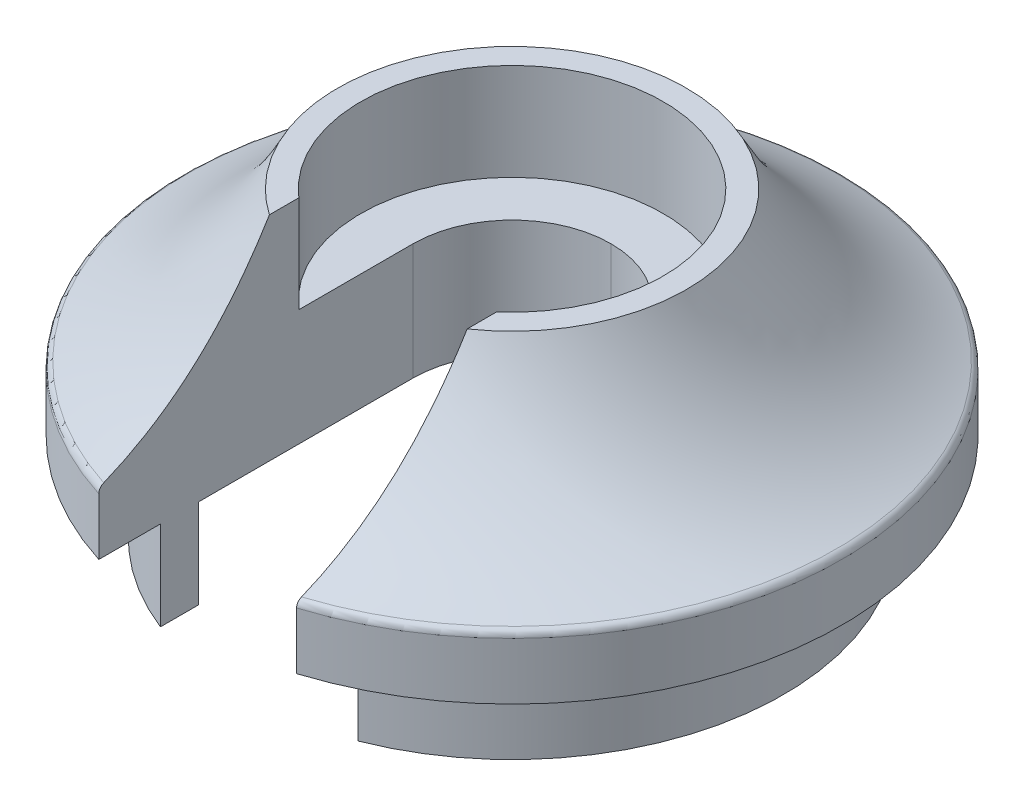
ISO-10303-21;
HEADER;
FILE_DESCRIPTION(('STEP AP214'),'2;1');
FILE_NAME('part.step','',(''),(''),'','','');
FILE_SCHEMA(('AUTOMOTIVE_DESIGN { 1 0 10303 214 1 1 1 1 }'));
ENDSEC;
DATA;
#1=APPLICATION_CONTEXT('core data for automotive mechanical design processes');
#2=APPLICATION_PROTOCOL_DEFINITION('international standard','automotive_design',2000,#1);
#3=PRODUCT_CONTEXT('',#1,'mechanical');
#4=PRODUCT('Part','Part','',(#3));
#5=PRODUCT_RELATED_PRODUCT_CATEGORY('part','',(#4));
#6=PRODUCT_DEFINITION_FORMATION('','',#4);
#7=PRODUCT_DEFINITION_CONTEXT('part definition',#1,'design');
#8=PRODUCT_DEFINITION('design','',#6,#7);
#9=PRODUCT_DEFINITION_SHAPE('','',#8);
#10=(LENGTH_UNIT() NAMED_UNIT(*) SI_UNIT(.MILLI.,.METRE.));
#11=(NAMED_UNIT(*) PLANE_ANGLE_UNIT() SI_UNIT($,.RADIAN.));
#12=(NAMED_UNIT(*) SI_UNIT($,.STERADIAN.) SOLID_ANGLE_UNIT());
#13=UNCERTAINTY_MEASURE_WITH_UNIT(LENGTH_MEASURE(1.E-05),#10,'distance_accuracy_value','');
#14=(GEOMETRIC_REPRESENTATION_CONTEXT(3) GLOBAL_UNCERTAINTY_ASSIGNED_CONTEXT((#13)) GLOBAL_UNIT_ASSIGNED_CONTEXT((#10,
#11,#12)) REPRESENTATION_CONTEXT('',''));
#15=CARTESIAN_POINT('',(0.,0.,0.));
#16=DIRECTION('',(0.,0.,1.));
#17=DIRECTION('',(1.,0.,0.));
#18=AXIS2_PLACEMENT_3D('',#15,#16,#17);
#19=CARTESIAN_POINT('',(-34.347512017,27.232210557,14.670039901));
#20=DIRECTION('',(0.,-1.,0.));
#21=DIRECTION('',(0.,0.,-1.));
#22=AXIS2_PLACEMENT_3D('',#19,#20,#21);
#23=CYLINDRICAL_SURFACE('',#22,7.);
#24=DIRECTION('',(0.,1.,0.));
#25=VECTOR('',#24,1.);
#26=CARTESIAN_POINT('',(-34.347512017,24.932210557,7.670039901));
#27=LINE('',#26,#25);
#28=CARTESIAN_POINT('',(-34.347512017,24.932210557,7.670039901));
#29=VERTEX_POINT('',#28);
#30=CARTESIAN_POINT('',(-34.347512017,27.232210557,7.670039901));
#31=VERTEX_POINT('',#30);
#32=EDGE_CURVE('E186',#29,#31,#27,.T.);
#33=ORIENTED_EDGE('',*,*,#32,.F.);
#34=CARTESIAN_POINT('',(-34.347512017,24.932210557,14.670039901));
#35=DIRECTION('',(0.,1.,0.));
#36=DIRECTION('',(0.,0.,-1.));
#37=AXIS2_PLACEMENT_3D('',#34,#35,#36);
#38=CIRCLE('',#37,7.);
#39=CARTESIAN_POINT('',(-36.897512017,24.932210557,21.189050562));
#40=VERTEX_POINT('',#39);
#41=EDGE_CURVE('E207',#29,#40,#38,.T.);
#42=ORIENTED_EDGE('',*,*,#41,.T.);
#43=DIRECTION('',(0.,-1.,0.));
#44=VECTOR('',#43,1.);
#45=CARTESIAN_POINT('',(-36.897512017,27.232210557,21.189050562));
#46=LINE('',#45,#44);
#47=CARTESIAN_POINT('',(-36.897512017,27.232210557,21.189050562));
#48=VERTEX_POINT('',#47);
#49=EDGE_CURVE('E279',#48,#40,#46,.T.);
#50=ORIENTED_EDGE('',*,*,#49,.F.);
#51=CARTESIAN_POINT('',(-34.347512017,27.232210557,14.670039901));
#52=DIRECTION('',(0.,1.,0.));
#53=DIRECTION('',(0.,0.,-1.));
#54=AXIS2_PLACEMENT_3D('',#51,#52,#53);
#55=CIRCLE('',#54,7.);
#56=EDGE_CURVE('E220',#31,#48,#55,.T.);
#57=ORIENTED_EDGE('',*,*,#56,.F.);
#58=EDGE_LOOP('',(#33,#42,#50,#57));
#59=FACE_BOUND('',#58,.T.);
#60=ADVANCED_FACE('F16',(#59),#23,.T.);
#61=CARTESIAN_POINT('',(-34.347512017,27.232210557,14.670039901));
#62=DIRECTION('',(0.,-1.,0.));
#63=DIRECTION('',(0.,0.,-1.));
#64=AXIS2_PLACEMENT_3D('',#61,#62,#63);
#65=CYLINDRICAL_SURFACE('',#64,6.1);
#66=DIRECTION('',(0.,1.,0.));
#67=VECTOR('',#66,1.);
#68=CARTESIAN_POINT('',(-34.347512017,24.932210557,8.570039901));
#69=LINE('',#68,#67);
#70=CARTESIAN_POINT('',(-34.347512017,24.932210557,8.570039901));
#71=VERTEX_POINT('',#70);
#72=CARTESIAN_POINT('',(-34.347512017,27.232210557,8.570039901));
#73=VERTEX_POINT('',#72);
#74=EDGE_CURVE('E197',#71,#73,#69,.T.);
#75=ORIENTED_EDGE('',*,*,#74,.T.);
#76=CARTESIAN_POINT('',(-34.347512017,27.232210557,14.670039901));
#77=DIRECTION('',(0.,1.,0.));
#78=DIRECTION('',(0.,0.,-1.));
#79=AXIS2_PLACEMENT_3D('',#76,#77,#78);
#80=CIRCLE('',#79,6.1);
#81=CARTESIAN_POINT('',(-36.897512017,27.232210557,20.211474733));
#82=VERTEX_POINT('',#81);
#83=EDGE_CURVE('E175',#73,#82,#80,.T.);
#84=ORIENTED_EDGE('',*,*,#83,.T.);
#85=DIRECTION('',(0.,-1.,0.));
#86=VECTOR('',#85,1.);
#87=CARTESIAN_POINT('',(-36.897512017,27.232210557,20.211474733));
#88=LINE('',#87,#86);
#89=CARTESIAN_POINT('',(-36.897512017,24.932210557,20.211474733));
#90=VERTEX_POINT('',#89);
#91=EDGE_CURVE('E28',#82,#90,#88,.T.);
#92=ORIENTED_EDGE('',*,*,#91,.T.);
#93=CARTESIAN_POINT('',(-34.347512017,24.932210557,14.670039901));
#94=DIRECTION('',(0.,1.,0.));
#95=DIRECTION('',(0.,0.,-1.));
#96=AXIS2_PLACEMENT_3D('',#93,#94,#95);
#97=CIRCLE('',#96,6.1);
#98=EDGE_CURVE('E206',#71,#90,#97,.T.);
#99=ORIENTED_EDGE('',*,*,#98,.F.);
#100=EDGE_LOOP('',(#75,#84,#92,#99));
#101=FACE_BOUND('',#100,.T.);
#102=ADVANCED_FACE('F761',(#101),#65,.F.);
#103=CARTESIAN_POINT('',(-34.347512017,28.832210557,14.670039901));
#104=DIRECTION('',(0.,-1.,0.));
#105=DIRECTION('',(0.,0.,-1.));
#106=AXIS2_PLACEMENT_3D('',#103,#104,#105);
#107=CYLINDRICAL_SURFACE('',#106,8.5);
#108=DIRECTION('',(0.,1.,0.));
#109=VECTOR('',#108,1.);
#110=CARTESIAN_POINT('',(-34.347512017,27.232210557,6.170039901));
#111=LINE('',#110,#109);
#112=CARTESIAN_POINT('',(-34.347512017,27.232210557,6.170039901));
#113=VERTEX_POINT('',#112);
#114=CARTESIAN_POINT('',(-34.347512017,28.698691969,6.170039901));
#115=VERTEX_POINT('',#114);
#116=EDGE_CURVE('E273',#113,#115,#111,.T.);
#117=ORIENTED_EDGE('',*,*,#116,.F.);
#118=CARTESIAN_POINT('',(-34.347512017,27.232210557,14.670039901));
#119=DIRECTION('',(0.,1.,0.));
#120=DIRECTION('',(0.,0.,-1.));
#121=AXIS2_PLACEMENT_3D('',#118,#119,#120);
#122=CIRCLE('',#121,8.5);
#123=CARTESIAN_POINT('',(-36.897512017,27.232210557,22.778523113));
#124=VERTEX_POINT('',#123);
#125=EDGE_CURVE('E247',#113,#124,#122,.T.);
#126=ORIENTED_EDGE('',*,*,#125,.T.);
#127=DIRECTION('',(0.,-1.,0.));
#128=VECTOR('',#127,1.);
#129=CARTESIAN_POINT('',(-36.897512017,28.698691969,22.778523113));
#130=LINE('',#129,#128);
#131=CARTESIAN_POINT('',(-36.897512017,28.698691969,22.778523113));
#132=VERTEX_POINT('',#131);
#133=EDGE_CURVE('E282',#132,#124,#130,.T.);
#134=ORIENTED_EDGE('',*,*,#133,.F.);
#135=CARTESIAN_POINT('',(-34.347512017,28.698691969,14.670039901));
#136=DIRECTION('',(0.,-1.,0.));
#137=DIRECTION('',(0.,0.,-1.));
#138=AXIS2_PLACEMENT_3D('',#135,#136,#137);
#139=CIRCLE('',#138,8.5);
#140=EDGE_CURVE('E11',#132,#115,#139,.T.);
#141=ORIENTED_EDGE('',*,*,#140,.T.);
#142=EDGE_LOOP('',(#117,#126,#134,#141));
#143=FACE_BOUND('',#142,.T.);
#144=ADVANCED_FACE('F319',(#143),#107,.T.);
#145=CARTESIAN_POINT('',(-34.347512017,28.698691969,14.670039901));
#146=DIRECTION('',(0.,-1.,0.));
#147=DIRECTION('',(0.,0.,-1.));
#148=AXIS2_PLACEMENT_3D('',#145,#146,#147);
#149=TOROIDAL_SURFACE('',#148,8.3,0.2);
#150=CARTESIAN_POINT('',(-34.347512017,28.698691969,6.370039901));
#151=DIRECTION('',(1.,0.,0.));
#152=DIRECTION('',(0.,0.,-1.));
#153=AXIS2_PLACEMENT_3D('',#150,#151,#152);
#154=CIRCLE('',#153,0.2);
#155=CARTESIAN_POINT('',(-34.347512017,28.882699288,6.291673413));
#156=VERTEX_POINT('',#155);
#157=EDGE_CURVE('E287',#115,#156,#154,.T.);
#158=ORIENTED_EDGE('',*,*,#157,.F.);
#159=ORIENTED_EDGE('',*,*,#140,.F.);
#160=CARTESIAN_POINT('',(-36.8975120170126,28.698691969,22.7785231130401));
#161=CARTESIAN_POINT('',(-36.8975120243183,28.7008552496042,22.7785231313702));
#162=CARTESIAN_POINT('',(-36.8975136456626,28.703018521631,22.7784858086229));
#163=CARTESIAN_POINT('',(-36.8975195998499,28.7073602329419,22.7783361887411));
#164=CARTESIAN_POINT('',(-36.8975239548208,28.7095386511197,22.7782232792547));
#165=CARTESIAN_POINT('',(-36.8975348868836,28.7139082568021,22.7779209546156));
#166=CARTESIAN_POINT('',(-36.8975414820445,28.716099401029,22.7777309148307));
#167=CARTESIAN_POINT('',(-36.8975564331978,28.7204919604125,22.7772728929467));
#168=CARTESIAN_POINT('',(-36.897564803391,28.7226933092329,22.7770042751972));
#169=CARTESIAN_POINT('',(-36.8975828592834,28.7271036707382,22.7763877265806));
#170=CARTESIAN_POINT('',(-36.8975925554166,28.7293125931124,22.7760391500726));
#171=CARTESIAN_POINT('',(-36.897612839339,28.7337353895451,22.7752613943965));
#172=CARTESIAN_POINT('',(-36.8976234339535,28.7359491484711,22.7748315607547));
#173=CARTESIAN_POINT('',(-36.8976451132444,28.7403788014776,22.7738900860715));
#174=CARTESIAN_POINT('',(-36.8976562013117,28.7425945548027,22.7733777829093));
#175=CARTESIAN_POINT('',(-36.8976784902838,28.7470252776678,22.7722702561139));
#176=CARTESIAN_POINT('',(-36.897689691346,28.7492400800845,22.7716743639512));
#177=CARTESIAN_POINT('',(-36.8977118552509,28.7536658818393,22.7703986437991));
#178=CARTESIAN_POINT('',(-36.8977228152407,28.7558766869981,22.7697181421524));
#179=CARTESIAN_POINT('',(-36.897744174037,28.7602913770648,22.7682722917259));
#180=CARTESIAN_POINT('',(-36.8977545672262,28.7624950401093,22.7675062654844));
#181=CARTESIAN_POINT('',(-36.8977744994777,28.7668922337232,22.7658885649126));
#182=CARTESIAN_POINT('',(-36.8977840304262,28.7690855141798,22.7650362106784));
#183=CARTESIAN_POINT('',(-36.8978019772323,28.7734586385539,22.7632451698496));
#184=CARTESIAN_POINT('',(-36.897810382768,28.7756382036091,22.7623058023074));
#185=CARTESIAN_POINT('',(-36.8978258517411,28.779980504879,22.7603401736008));
#186=CARTESIAN_POINT('',(-36.8978329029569,28.782142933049,22.7593132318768));
#187=CARTESIAN_POINT('',(-36.8978454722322,28.7864474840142,22.7571720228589));
#188=CARTESIAN_POINT('',(-36.8978509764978,28.7885892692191,22.7560570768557));
#189=CARTESIAN_POINT('',(-36.8978602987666,28.7928489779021,22.7537395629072));
#190=CARTESIAN_POINT('',(-36.8978641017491,28.7949665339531,22.7525363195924));
#191=CARTESIAN_POINT('',(-36.8978699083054,28.7991741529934,22.750042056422));
#192=CARTESIAN_POINT('',(-36.897871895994,28.8012638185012,22.7487503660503));
#193=CARTESIAN_POINT('',(-36.8978740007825,28.8054119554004,22.7460792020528));
#194=CARTESIAN_POINT('',(-36.8978741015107,28.8074699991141,22.7446990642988));
#195=CARTESIAN_POINT('',(-36.8978724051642,28.8115511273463,22.7418511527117));
#196=CARTESIAN_POINT('',(-36.8978705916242,28.8135737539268,22.7403827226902));
#197=CARTESIAN_POINT('',(-36.8978650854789,28.8175802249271,22.7373585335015));
#198=CARTESIAN_POINT('',(-36.8978613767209,28.8195635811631,22.7358021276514));
#199=CARTESIAN_POINT('',(-36.8978521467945,28.8234876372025,22.7326024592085));
#200=CARTESIAN_POINT('',(-36.8978466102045,28.8254278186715,22.7309585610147));
#201=CARTESIAN_POINT('',(-36.897833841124,28.8292616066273,22.7275845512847));
#202=CARTESIAN_POINT('',(-36.8978265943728,28.8311546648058,22.7258538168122));
#203=CARTESIAN_POINT('',(-36.8978105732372,28.8348902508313,22.722306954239));
#204=CARTESIAN_POINT('',(-36.8978017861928,28.8367322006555,22.7204902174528));
#205=CARTESIAN_POINT('',(-36.8977829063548,28.8403615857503,22.7167723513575));
#206=CARTESIAN_POINT('',(-36.8977728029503,28.8421484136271,22.7148706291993));
#207=CARTESIAN_POINT('',(-36.8977515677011,28.8456635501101,22.7109839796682));
#208=CARTESIAN_POINT('',(-36.8977404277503,28.8473912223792,22.7089984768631));
#209=CARTESIAN_POINT('',(-36.8977174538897,28.8507840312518,22.7049456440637));
#210=CARTESIAN_POINT('',(-36.8977056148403,28.8524485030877,22.7028777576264));
#211=CARTESIAN_POINT('',(-36.8976816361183,28.8557108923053,22.6986617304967));
#212=CARTESIAN_POINT('',(-36.897669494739,28.8573081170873,22.6965130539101));
#213=CARTESIAN_POINT('',(-36.8976453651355,28.8604320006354,22.6921372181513));
#214=CARTESIAN_POINT('',(-36.8976333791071,28.8619579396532,22.6899095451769));
#215=CARTESIAN_POINT('',(-36.8976100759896,28.8649352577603,22.6853776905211));
#216=CARTESIAN_POINT('',(-36.8975987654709,28.8663858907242,22.6830730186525));
#217=CARTESIAN_POINT('',(-36.8975773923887,28.8692086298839,22.6783893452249));
#218=CARTESIAN_POINT('',(-36.8975673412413,28.8705799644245,22.676009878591));
#219=CARTESIAN_POINT('',(-36.8975491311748,28.8732401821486,22.6711790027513));
#220=CARTESIAN_POINT('',(-36.8975409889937,28.8745282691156,22.6687271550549));
#221=CARTESIAN_POINT('',(-36.8975273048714,28.8770181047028,22.6637541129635));
#222=CARTESIAN_POINT('',(-36.8975217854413,28.8782190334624,22.6612325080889));
#223=CARTESIAN_POINT('',(-36.8975141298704,28.8805307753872,22.6561227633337));
#224=CARTESIAN_POINT('',(-36.8975120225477,28.8816407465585,22.6535342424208));
#225=CARTESIAN_POINT('',(-36.8975120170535,28.8826992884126,22.6509248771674));
#226=B_SPLINE_CURVE_WITH_KNOTS('',3,(#160,#161,#162,#163,#164,#165,#166,#167,#168,#169,#170,
#171,#172,#173,#174,#175,#176,#177,#178,#179,#180,#181,#182,#183,#184,#185,#186,#187,#188,#189,
#190,#191,#192,#193,#194,#195,#196,#197,#198,#199,#200,#201,#202,#203,#204,#205,#206,#207,#208,
#209,#210,#211,#212,#213,#214,#215,#216,#217,#218,#219,#220,#221,#222,#223,#224,#225),
.UNSPECIFIED.,.F.,.F.,(4,2,2,2,2,2,2,2,2,2,2,2,2,2,2,2,2,2,2,2,2,2,2,2,2,2,2,2,2,2,2,2,4),(0.,
0.00648950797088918,0.0130322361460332,0.0196290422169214,0.0262807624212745,0.032988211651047,
0.0397521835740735,0.0465734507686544,0.0534527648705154,0.0603908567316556,0.0673884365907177,
0.0744461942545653,0.0815647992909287,0.0887449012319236,0.0959871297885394,0.103292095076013,
0.110660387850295,0.118092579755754,0.125589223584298,0.133150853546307,0.140777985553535,
0.14847111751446,0.15623072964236,0.164057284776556,0.171951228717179,0.179912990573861,
0.18794298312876,0.196041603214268,0.204209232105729,0.21244623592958,0.22075296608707,
0.229129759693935,0.237576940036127),.UNSPECIFIED.);
#227=CARTESIAN_POINT('',(-36.897512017,28.882699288,22.650924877));
#228=VERTEX_POINT('',#227);
#229=EDGE_CURVE('E264',#132,#228,#226,.T.);
#230=ORIENTED_EDGE('',*,*,#229,.T.);
#231=CARTESIAN_POINT('',(-34.347512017,28.882699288,14.670039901));
#232=DIRECTION('',(0.,1.,0.));
#233=DIRECTION('',(0.,0.,-1.));
#234=AXIS2_PLACEMENT_3D('',#231,#232,#233);
#235=CIRCLE('',#234,8.378366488);
#236=EDGE_CURVE('E458',#156,#228,#235,.T.);
#237=ORIENTED_EDGE('',*,*,#236,.F.);
#238=EDGE_LOOP('',(#158,#159,#230,#237));
#239=FACE_BOUND('',#238,.T.);
#240=ADVANCED_FACE('F308',(#239),#149,.T.);
#241=CARTESIAN_POINT('',(-34.347512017,34.932210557,14.670039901));
#242=DIRECTION('',(0.,-1.,0.));
#243=DIRECTION('',(0.,0.,-1.));
#244=AXIS2_PLACEMENT_3D('',#241,#242,#243);
#245=CYLINDRICAL_SURFACE('',#244,2.55);
#246=DIRECTION('',(0.,1.,0.));
#247=VECTOR('',#246,1.);
#248=CARTESIAN_POINT('',(-34.347512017,27.232210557,12.120039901));
#249=LINE('',#248,#247);
#250=CARTESIAN_POINT('',(-34.347512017,27.232210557,12.120039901));
#251=VERTEX_POINT('',#250);
#252=CARTESIAN_POINT('',(-34.347512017,30.232210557,12.120039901));
#253=VERTEX_POINT('',#252);
#254=EDGE_CURVE('E229',#251,#253,#249,.T.);
#255=ORIENTED_EDGE('',*,*,#254,.T.);
#256=CARTESIAN_POINT('',(-34.347512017,30.232210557,14.670039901));
#257=DIRECTION('',(0.,-1.,0.));
#258=DIRECTION('',(0.,0.,-1.));
#259=AXIS2_PLACEMENT_3D('',#256,#257,#258);
#260=CIRCLE('',#259,2.55);
#261=CARTESIAN_POINT('',(-36.897512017,30.232210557,14.670039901));
#262=VERTEX_POINT('',#261);
#263=EDGE_CURVE('E525',#262,#253,#260,.T.);
#264=ORIENTED_EDGE('',*,*,#263,.F.);
#265=DIRECTION('',(0.,-1.,0.));
#266=VECTOR('',#265,1.);
#267=CARTESIAN_POINT('',(-36.897512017,30.232210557,14.670039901));
#268=LINE('',#267,#266);
#269=CARTESIAN_POINT('',(-36.897512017,27.232210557,14.670039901));
#270=VERTEX_POINT('',#269);
#271=EDGE_CURVE('E262',#262,#270,#268,.T.);
#272=ORIENTED_EDGE('',*,*,#271,.T.);
#273=CARTESIAN_POINT('',(-34.347512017,27.232210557,14.670039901));
#274=DIRECTION('',(0.,-1.,0.));
#275=DIRECTION('',(0.,0.,-1.));
#276=AXIS2_PLACEMENT_3D('',#273,#274,#275);
#277=CIRCLE('',#276,2.55);
#278=EDGE_CURVE('E174',#270,#251,#277,.T.);
#279=ORIENTED_EDGE('',*,*,#278,.T.);
#280=EDGE_LOOP('',(#255,#264,#272,#279));
#281=FACE_BOUND('',#280,.T.);
#282=ADVANCED_FACE('F318',(#281),#245,.F.);
#283=CARTESIAN_POINT('',(-31.797512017,34.932210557,26.007758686));
#284=DIRECTION('',(-1.,0.,0.));
#285=DIRECTION('',(0.,0.,1.));
#286=AXIS2_PLACEMENT_3D('',#283,#284,#285);
#287=PLANE('',#286);
#288=DIRECTION('',(0.,0.,-1.));
#289=VECTOR('',#288,1.);
#290=CARTESIAN_POINT('',(-31.797512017,24.932210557,21.189050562));
#291=LINE('',#290,#289);
#292=CARTESIAN_POINT('',(-31.797512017,24.932210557,21.189050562));
#293=VERTEX_POINT('',#292);
#294=CARTESIAN_POINT('',(-31.797512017,24.932210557,20.211474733));
#295=VERTEX_POINT('',#294);
#296=EDGE_CURVE('E203',#293,#295,#291,.T.);
#297=ORIENTED_EDGE('',*,*,#296,.F.);
#298=DIRECTION('',(0.,1.,0.));
#299=VECTOR('',#298,1.);
#300=CARTESIAN_POINT('',(-31.797512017,24.932210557,21.189050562));
#301=LINE('',#300,#299);
#302=CARTESIAN_POINT('',(-31.797512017,27.232210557,21.189050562));
#303=VERTEX_POINT('',#302);
#304=EDGE_CURVE('E214',#293,#303,#301,.T.);
#305=ORIENTED_EDGE('',*,*,#304,.T.);
#306=DIRECTION('',(0.,0.,1.));
#307=VECTOR('',#306,1.);
#308=CARTESIAN_POINT('',(-31.797512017,27.232210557,21.189050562));
#309=LINE('',#308,#307);
#310=CARTESIAN_POINT('',(-31.797512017,27.232210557,22.778523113));
#311=VERTEX_POINT('',#310);
#312=EDGE_CURVE('E225',#303,#311,#309,.T.);
#313=ORIENTED_EDGE('',*,*,#312,.T.);
#314=DIRECTION('',(0.,1.,0.));
#315=VECTOR('',#314,1.);
#316=CARTESIAN_POINT('',(-31.797512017,27.232210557,22.778523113));
#317=LINE('',#316,#315);
#318=CARTESIAN_POINT('',(-31.797512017,28.698691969,22.778523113));
#319=VERTEX_POINT('',#318);
#320=EDGE_CURVE('E277',#311,#319,#317,.T.);
#321=ORIENTED_EDGE('',*,*,#320,.T.);
#322=CARTESIAN_POINT('',(-31.7975120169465,28.8826992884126,22.6509248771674));
#323=CARTESIAN_POINT('',(-31.7975120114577,28.881640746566,22.653534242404));
#324=CARTESIAN_POINT('',(-31.7975099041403,28.8805307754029,22.6561227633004));
#325=CARTESIAN_POINT('',(-31.7975022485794,28.8782190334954,22.6612325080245));
#326=CARTESIAN_POINT('',(-31.797496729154,28.8770181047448,22.6637541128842));
#327=CARTESIAN_POINT('',(-31.7974830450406,28.8745282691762,22.6687271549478));
#328=CARTESIAN_POINT('',(-31.7974749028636,28.873240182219,22.6711790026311));
#329=CARTESIAN_POINT('',(-31.7974566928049,28.8705799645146,22.6760098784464));
#330=CARTESIAN_POINT('',(-31.7974466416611,28.869208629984,22.678389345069));
#331=CARTESIAN_POINT('',(-31.7974252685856,28.8663858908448,22.6830730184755));
#332=CARTESIAN_POINT('',(-31.7974139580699,28.8649352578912,22.6853776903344));
#333=CARTESIAN_POINT('',(-31.797390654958,28.8619579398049,22.6899095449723));
#334=CARTESIAN_POINT('',(-31.7973786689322,28.8604320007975,22.6921372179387));
#335=CARTESIAN_POINT('',(-31.7973545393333,28.8573081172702,22.6965130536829));
#336=CARTESIAN_POINT('',(-31.797342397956,28.8557108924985,22.698661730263));
#337=CARTESIAN_POINT('',(-31.7973184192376,28.8524485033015,22.7028777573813));
#338=CARTESIAN_POINT('',(-31.7973065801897,28.8507840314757,22.7049456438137));
#339=CARTESIAN_POINT('',(-31.7972836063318,28.847391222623,22.7089984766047));
#340=CARTESIAN_POINT('',(-31.7972724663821,28.8456635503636,22.7109839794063));
#341=CARTESIAN_POINT('',(-31.7972512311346,28.8421484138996,22.7148706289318));
#342=CARTESIAN_POINT('',(-31.7972411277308,28.840361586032,22.716772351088));
#343=CARTESIAN_POINT('',(-31.7972222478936,28.836732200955,22.7204902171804));
#344=CARTESIAN_POINT('',(-31.7972134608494,28.8348902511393,22.7223069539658));
#345=CARTESIAN_POINT('',(-31.7971974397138,28.8311546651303,22.7258538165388));
#346=CARTESIAN_POINT('',(-31.7971901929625,28.8292616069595,22.7275845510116));
#347=CARTESIAN_POINT('',(-31.7971774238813,28.8254278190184,22.7309585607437));
#348=CARTESIAN_POINT('',(-31.7971718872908,28.8234876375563,22.7326024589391));
#349=CARTESIAN_POINT('',(-31.797162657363,28.8195635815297,22.7358021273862));
#350=CARTESIAN_POINT('',(-31.7971589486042,28.8175802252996,22.7373585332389));
#351=CARTESIAN_POINT('',(-31.7971534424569,28.8135737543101,22.7403827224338));
#352=CARTESIAN_POINT('',(-31.7971516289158,28.8115511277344,22.7418511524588));
#353=CARTESIAN_POINT('',(-31.7971499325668,28.8074699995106,22.7446990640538));
#354=CARTESIAN_POINT('',(-31.7971500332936,28.8054119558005,22.7460792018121));
#355=CARTESIAN_POINT('',(-31.7971521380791,28.8012638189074,22.748750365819));
#356=CARTESIAN_POINT('',(-31.7971541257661,28.799174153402,22.7500420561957));
#357=CARTESIAN_POINT('',(-31.797159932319,28.7949665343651,22.7525363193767));
#358=CARTESIAN_POINT('',(-31.7971637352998,28.7928489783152,22.7537395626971));
#359=CARTESIAN_POINT('',(-31.7971730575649,28.788589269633,22.7560570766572));
#360=CARTESIAN_POINT('',(-31.7971785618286,28.7864474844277,22.7571720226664));
#361=CARTESIAN_POINT('',(-31.7971911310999,28.7821429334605,22.7593132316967));
#362=CARTESIAN_POINT('',(-31.7971981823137,28.7799805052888,22.760340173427));
#363=CARTESIAN_POINT('',(-31.7972136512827,28.775638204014,22.7623058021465));
#364=CARTESIAN_POINT('',(-31.7972220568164,28.7734586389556,22.7632451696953));
#365=CARTESIAN_POINT('',(-31.7972400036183,28.7690855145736,22.7650362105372));
#366=CARTESIAN_POINT('',(-31.7972495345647,28.7668922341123,22.7658885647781));
#367=CARTESIAN_POINT('',(-31.7972694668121,28.7624950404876,22.7675062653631));
#368=CARTESIAN_POINT('',(-31.7972798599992,28.7602913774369,22.7682722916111));
#369=CARTESIAN_POINT('',(-31.7973012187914,28.7558766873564,22.7697181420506));
#370=CARTESIAN_POINT('',(-31.7973121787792,28.7536658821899,22.7703986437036));
#371=CARTESIAN_POINT('',(-31.7973343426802,28.7492400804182,22.7716743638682));
#372=CARTESIAN_POINT('',(-31.7973455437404,28.7470252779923,22.772270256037));
#373=CARTESIAN_POINT('',(-31.7973678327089,28.7425945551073,22.773377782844));
#374=CARTESIAN_POINT('',(-31.7973789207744,28.7403788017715,22.7738900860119));
#375=CARTESIAN_POINT('',(-31.7974006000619,28.7359491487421,22.7748315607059));
#376=CARTESIAN_POINT('',(-31.7974111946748,28.7337353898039,22.7752613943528));
#377=CARTESIAN_POINT('',(-31.7974314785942,28.7293125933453,22.7760391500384));
#378=CARTESIAN_POINT('',(-31.797441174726,28.7271036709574,22.7763877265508));
#379=CARTESIAN_POINT('',(-31.7974592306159,28.7226933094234,22.7770042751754));
#380=CARTESIAN_POINT('',(-31.7974676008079,28.7204919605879,22.7772728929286));
#381=CARTESIAN_POINT('',(-31.7974825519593,28.7160994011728,22.7777309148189));
#382=CARTESIAN_POINT('',(-31.7974891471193,28.7139082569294,22.7779209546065));
#383=CARTESIAN_POINT('',(-31.7975000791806,28.7095386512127,22.7782232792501));
#384=CARTESIAN_POINT('',(-31.797504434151,28.7073602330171,22.7783361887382));
#385=CARTESIAN_POINT('',(-31.7975103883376,28.7030185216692,22.7784858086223));
#386=CARTESIAN_POINT('',(-31.7975120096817,28.7008552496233,22.7785231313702));
#387=CARTESIAN_POINT('',(-31.7975120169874,28.698691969,22.7785231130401));
#388=B_SPLINE_CURVE_WITH_KNOTS('',3,(#322,#323,#324,#325,#326,#327,#328,#329,#330,#331,#332,
#333,#334,#335,#336,#337,#338,#339,#340,#341,#342,#343,#344,#345,#346,#347,#348,#349,#350,#351,
#352,#353,#354,#355,#356,#357,#358,#359,#360,#361,#362,#363,#364,#365,#366,#367,#368,#369,#370,
#371,#372,#373,#374,#375,#376,#377,#378,#379,#380,#381,#382,#383,#384,#385,#386,#387),
.UNSPECIFIED.,.F.,.F.,(4,2,2,2,2,2,2,2,2,2,2,2,2,2,2,2,2,2,2,2,2,2,2,2,2,2,2,2,2,2,2,2,4),(0.,
0.00844718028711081,0.0168239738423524,0.0251307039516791,0.0333677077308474,0.0415353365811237,
0.0496339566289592,0.0576639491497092,0.0656257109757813,0.0735196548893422,0.0813462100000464,
0.0891058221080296,0.0967989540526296,0.104426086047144,0.111987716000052,0.11948435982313,
0.126916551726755,0.134284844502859,0.141589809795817,0.148832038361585,0.156012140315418,
0.163130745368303,0.170188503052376,0.177186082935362,0.184124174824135,0.191003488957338,
0.197824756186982,0.204588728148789,0.211296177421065,0.217947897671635,0.22454470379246,
0.231087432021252,0.237576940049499),.UNSPECIFIED.);
#389=CARTESIAN_POINT('',(-31.797512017,28.882699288,22.650924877));
#390=VERTEX_POINT('',#389);
#391=EDGE_CURVE('E346',#390,#319,#388,.T.);
#392=ORIENTED_EDGE('',*,*,#391,.F.);
#393=CARTESIAN_POINT('',(-31.797512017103,32.7322105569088,18.3778020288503));
#394=CARTESIAN_POINT('',(-31.7975115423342,32.62300743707,18.4443533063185));
#395=CARTESIAN_POINT('',(-31.7975005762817,32.5147383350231,18.5124531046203));
#396=CARTESIAN_POINT('',(-31.7974698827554,32.3018780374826,18.6508785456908));
#397=CARTESIAN_POINT('',(-31.7974502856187,32.197256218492,18.721157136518));
#398=CARTESIAN_POINT('',(-31.7974140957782,31.9917374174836,18.8640037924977));
#399=CARTESIAN_POINT('',(-31.797397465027,31.8908088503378,18.9365263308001));
#400=CARTESIAN_POINT('',(-31.7973741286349,31.6927289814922,19.083917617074));
#401=CARTESIAN_POINT('',(-31.7973672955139,31.5955454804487,19.1587430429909));
#402=CARTESIAN_POINT('',(-31.7973662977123,31.4050064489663,19.310793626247));
#403=CARTESIAN_POINT('',(-31.7973719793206,31.3116186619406,19.3879783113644));
#404=CARTESIAN_POINT('',(-31.7973939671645,31.1287217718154,19.544797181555));
#405=CARTESIAN_POINT('',(-31.7974101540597,31.0391810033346,19.6243943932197));
#406=CARTESIAN_POINT('',(-31.7974467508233,30.8640283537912,19.7860851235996));
#407=CARTESIAN_POINT('',(-31.7974671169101,30.7783861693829,19.868145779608));
#408=CARTESIAN_POINT('',(-31.7974990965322,30.6110800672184,20.0348067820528));
#409=CARTESIAN_POINT('',(-31.7975107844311,30.5293880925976,20.1193789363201));
#410=CARTESIAN_POINT('',(-31.7975132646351,30.3684740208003,20.2927849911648));
#411=CARTESIAN_POINT('',(-31.7975037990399,30.2892944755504,20.3816584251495));
#412=CARTESIAN_POINT('',(-31.7974793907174,30.1345437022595,20.5628877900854));
#413=CARTESIAN_POINT('',(-31.7974644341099,30.0589821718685,20.655252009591));
#414=CARTESIAN_POINT('',(-31.797436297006,29.9116291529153,20.8435763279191));
#415=CARTESIAN_POINT('',(-31.797423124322,29.8398550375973,20.939550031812));
#416=CARTESIAN_POINT('',(-31.7974043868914,29.70023945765,21.1352062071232));
#417=CARTESIAN_POINT('',(-31.797398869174,29.6324247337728,21.2349077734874));
#418=CARTESIAN_POINT('',(-31.7973975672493,29.5008910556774,21.438132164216));
#419=CARTESIAN_POINT('',(-31.7974018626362,29.4372099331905,21.5416794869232));
#420=CARTESIAN_POINT('',(-31.7974188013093,29.3141059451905,21.7527075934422));
#421=CARTESIAN_POINT('',(-31.7974315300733,29.254733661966,21.8602178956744));
#422=CARTESIAN_POINT('',(-31.7974603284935,29.1404141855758,22.0792858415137));
#423=CARTESIAN_POINT('',(-31.7974764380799,29.0855318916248,22.190877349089));
#424=CARTESIAN_POINT('',(-31.7975020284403,28.9803449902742,22.4182178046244));
#425=CARTESIAN_POINT('',(-31.797511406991,28.9301206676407,22.5340039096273));
#426=CARTESIAN_POINT('',(-31.797512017,28.882699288,22.650924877));
#427=B_SPLINE_CURVE_WITH_KNOTS('',3,(#393,#394,#395,#396,#397,#398,#399,#400,#401,#402,#403,
#404,#405,#406,#407,#408,#409,#410,#411,#412,#413,#414,#415,#416,#417,#418,#419,#420,#421,#422,
#423,#424,#425,#426),.UNSPECIFIED.,.F.,.F.,(4,2,2,2,2,2,2,2,2,2,2,2,2,2,2,2,4),(0.,
0.383652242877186,0.761699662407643,1.13448112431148,1.5023667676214,1.86575911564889,
2.22509391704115,2.58084065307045,2.93350264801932,3.29048767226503,3.6483813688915,
4.00779495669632,4.36940701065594,4.73396250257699,5.10227071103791,5.47520200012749,
5.85368353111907),.UNSPECIFIED.);
#428=CARTESIAN_POINT('',(-31.797512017,32.732210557,18.377802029));
#429=VERTEX_POINT('',#428);
#430=EDGE_CURVE('E224',#429,#390,#427,.T.);
#431=ORIENTED_EDGE('',*,*,#430,.F.);
#432=DIRECTION('',(0.,0.,1.));
#433=VECTOR('',#432,1.);
#434=CARTESIAN_POINT('',(-31.797512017,32.732210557,17.620887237));
#435=LINE('',#434,#433);
#436=CARTESIAN_POINT('',(-31.797512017,32.732210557,17.620887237));
#437=VERTEX_POINT('',#436);
#438=EDGE_CURVE('E265',#437,#429,#435,.T.);
#439=ORIENTED_EDGE('',*,*,#438,.F.);
#440=DIRECTION('',(0.,-1.,0.));
#441=VECTOR('',#440,1.);
#442=CARTESIAN_POINT('',(-31.797512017,32.732210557,17.620887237));
#443=LINE('',#442,#441);
#444=CARTESIAN_POINT('',(-31.797512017,30.232210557,17.620887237));
#445=VERTEX_POINT('',#444);
#446=EDGE_CURVE('E260',#437,#445,#443,.T.);
#447=ORIENTED_EDGE('',*,*,#446,.T.);
#448=DIRECTION('',(0.,0.,1.));
#449=VECTOR('',#448,1.);
#450=CARTESIAN_POINT('',(-31.797512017,30.232210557,14.670039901));
#451=LINE('',#450,#449);
#452=CARTESIAN_POINT('',(-31.797512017,30.232210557,14.670039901));
#453=VERTEX_POINT('',#452);
#454=EDGE_CURVE('E201',#453,#445,#451,.T.);
#455=ORIENTED_EDGE('',*,*,#454,.F.);
#456=DIRECTION('',(0.,-1.,0.));
#457=VECTOR('',#456,1.);
#458=CARTESIAN_POINT('',(-31.797512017,30.232210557,14.670039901));
#459=LINE('',#458,#457);
#460=CARTESIAN_POINT('',(-31.797512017,27.232210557,14.670039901));
#461=VERTEX_POINT('',#460);
#462=EDGE_CURVE('E169',#453,#461,#459,.T.);
#463=ORIENTED_EDGE('',*,*,#462,.T.);
#464=DIRECTION('',(0.,0.,1.));
#465=VECTOR('',#464,1.);
#466=CARTESIAN_POINT('',(-31.797512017,27.232210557,14.670039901));
#467=LINE('',#466,#465);
#468=CARTESIAN_POINT('',(-31.797512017,27.232210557,20.211474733));
#469=VERTEX_POINT('',#468);
#470=EDGE_CURVE('E162',#461,#469,#467,.T.);
#471=ORIENTED_EDGE('',*,*,#470,.T.);
#472=DIRECTION('',(0.,1.,0.));
#473=VECTOR('',#472,1.);
#474=CARTESIAN_POINT('',(-31.797512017,24.932210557,20.211474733));
#475=LINE('',#474,#473);
#476=EDGE_CURVE('E166',#295,#469,#475,.T.);
#477=ORIENTED_EDGE('',*,*,#476,.F.);
#478=EDGE_LOOP('',(#297,#305,#313,#321,#392,#431,#439,#447,#455,#463,#471,#477));
#479=FACE_BOUND('',#478,.T.);
#480=ADVANCED_FACE('F164',(#479),#287,.T.);
#481=CARTESIAN_POINT('',(-36.897512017,34.932210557,14.670039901));
#482=DIRECTION('',(1.,0.,0.));
#483=DIRECTION('',(0.,1.,0.));
#484=AXIS2_PLACEMENT_3D('',#481,#482,#483);
#485=PLANE('',#484);
#486=DIRECTION('',(0.,0.,-1.));
#487=VECTOR('',#486,1.);
#488=CARTESIAN_POINT('',(-36.897512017,27.232210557,20.211474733));
#489=LINE('',#488,#487);
#490=EDGE_CURVE('E238',#82,#270,#489,.T.);
#491=ORIENTED_EDGE('',*,*,#490,.T.);
#492=ORIENTED_EDGE('',*,*,#271,.F.);
#493=DIRECTION('',(0.,0.,-1.));
#494=VECTOR('',#493,1.);
#495=CARTESIAN_POINT('',(-36.897512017,30.232210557,17.620887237));
#496=LINE('',#495,#494);
#497=CARTESIAN_POINT('',(-36.897512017,30.232210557,17.620887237));
#498=VERTEX_POINT('',#497);
#499=EDGE_CURVE('E255',#498,#262,#496,.T.);
#500=ORIENTED_EDGE('',*,*,#499,.F.);
#501=DIRECTION('',(0.,1.,0.));
#502=VECTOR('',#501,1.);
#503=CARTESIAN_POINT('',(-36.897512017,30.232210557,17.620887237));
#504=LINE('',#503,#502);
#505=CARTESIAN_POINT('',(-36.897512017,32.732210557,17.620887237));
#506=VERTEX_POINT('',#505);
#507=EDGE_CURVE('E257',#498,#506,#504,.T.);
#508=ORIENTED_EDGE('',*,*,#507,.T.);
#509=DIRECTION('',(0.,0.,-1.));
#510=VECTOR('',#509,1.);
#511=CARTESIAN_POINT('',(-36.897512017,32.732210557,18.377802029));
#512=LINE('',#511,#510);
#513=CARTESIAN_POINT('',(-36.897512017,32.732210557,18.377802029));
#514=VERTEX_POINT('',#513);
#515=EDGE_CURVE('E299',#514,#506,#512,.T.);
#516=ORIENTED_EDGE('',*,*,#515,.F.);
#517=CARTESIAN_POINT('',(-36.897512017,28.882699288,22.650924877));
#518=CARTESIAN_POINT('',(-36.8975126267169,28.9301133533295,22.5340219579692));
#519=CARTESIAN_POINT('',(-36.8975220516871,28.9803294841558,22.4182535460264));
#520=CARTESIAN_POINT('',(-36.8975477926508,29.0854989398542,22.1909462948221));
#521=CARTESIAN_POINT('',(-36.8975640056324,29.1403720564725,22.0793703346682));
#522=CARTESIAN_POINT('',(-36.8975930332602,29.2546723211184,21.8603314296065));
#523=CARTESIAN_POINT('',(-36.8976058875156,29.3140346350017,21.7528346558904));
#524=CARTESIAN_POINT('',(-36.8976230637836,29.4371180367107,21.5418316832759));
#525=CARTESIAN_POINT('',(-36.8976274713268,29.5007885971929,21.43829599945));
#526=CARTESIAN_POINT('',(-36.8976263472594,29.6323007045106,21.2350930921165));
#527=CARTESIAN_POINT('',(-36.8976208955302,29.7001044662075,21.1354014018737));
#528=CARTESIAN_POINT('',(-36.8976022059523,29.8396978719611,20.9397633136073));
#529=CARTESIAN_POINT('',(-36.8975890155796,29.9114608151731,20.8437978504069));
#530=CARTESIAN_POINT('',(-36.8975607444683,30.0587914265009,20.6554884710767));
#531=CARTESIAN_POINT('',(-36.897545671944,30.1343417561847,20.5631309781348));
#532=CARTESIAN_POINT('',(-36.8975208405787,30.2890702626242,20.3819136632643));
#533=CARTESIAN_POINT('',(-36.8975110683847,30.3682387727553,20.2930455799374));
#534=CARTESIAN_POINT('',(-36.8975129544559,30.529145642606,20.1196332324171));
#535=CARTESIAN_POINT('',(-36.8975243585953,30.6108421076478,20.0350500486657));
#536=CARTESIAN_POINT('',(-36.8975559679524,30.7781586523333,19.868366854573));
#537=CARTESIAN_POINT('',(-36.8975762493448,30.8638068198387,19.7862950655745));
#538=CARTESIAN_POINT('',(-36.8976127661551,31.0389729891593,19.6245819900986));
#539=CARTESIAN_POINT('',(-36.8976289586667,31.128521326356,19.5449735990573));
#540=CARTESIAN_POINT('',(-36.8976510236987,31.3114349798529,19.3881323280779));
#541=CARTESIAN_POINT('',(-36.897656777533,31.4048319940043,19.3109364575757));
#542=CARTESIAN_POINT('',(-36.897655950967,31.5953911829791,19.1588635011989));
#543=CARTESIAN_POINT('',(-36.8976492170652,31.6925856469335,19.0840269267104));
#544=CARTESIAN_POINT('',(-36.8976260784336,31.890689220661,18.9366133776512));
#545=CARTESIAN_POINT('',(-36.8976095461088,31.9916305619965,18.8640797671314));
#546=CARTESIAN_POINT('',(-36.897573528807,32.1971767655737,18.7212110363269));
#547=CARTESIAN_POINT('',(-36.8975540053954,32.3018132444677,18.6509214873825));
#548=CARTESIAN_POINT('',(-36.8975234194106,32.5147047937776,18.5124742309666));
#549=CARTESIAN_POINT('',(-36.897512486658,32.6229905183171,18.4443636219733));
#550=CARTESIAN_POINT('',(-36.8975120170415,32.732210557,18.3778020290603));
#551=B_SPLINE_CURVE_WITH_KNOTS('',3,(#517,#518,#519,#520,#521,#522,#523,#524,#525,#526,#527,
#528,#529,#530,#531,#532,#533,#534,#535,#536,#537,#538,#539,#540,#541,#542,#543,#544,#545,#546,
#547,#548,#549,#550),.UNSPECIFIED.,.F.,.F.,(4,2,2,2,2,2,2,2,2,2,2,2,2,2,2,2,4),(0.,
0.37842312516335,0.751300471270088,1.11955874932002,1.48406794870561,1.8456370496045,
2.20501080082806,2.56286762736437,2.91981866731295,3.27251378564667,3.62829655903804,
3.9876705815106,4.35110561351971,4.71903769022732,5.09186962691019,5.46997185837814,
5.85368354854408),.UNSPECIFIED.);
#552=EDGE_CURVE('E432',#228,#514,#551,.T.);
#553=ORIENTED_EDGE('',*,*,#552,.F.);
#554=ORIENTED_EDGE('',*,*,#229,.F.);
#555=ORIENTED_EDGE('',*,*,#133,.T.);
#556=DIRECTION('',(0.,0.,-1.));
#557=VECTOR('',#556,1.);
#558=CARTESIAN_POINT('',(-36.897512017,27.232210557,22.778523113));
#559=LINE('',#558,#557);
#560=EDGE_CURVE('E210',#124,#48,#559,.T.);
#561=ORIENTED_EDGE('',*,*,#560,.T.);
#562=ORIENTED_EDGE('',*,*,#49,.T.);
#563=DIRECTION('',(0.,0.,1.));
#564=VECTOR('',#563,1.);
#565=CARTESIAN_POINT('',(-36.897512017,24.932210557,20.211474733));
#566=LINE('',#565,#564);
#567=EDGE_CURVE('E237',#90,#40,#566,.T.);
#568=ORIENTED_EDGE('',*,*,#567,.F.);
#569=ORIENTED_EDGE('',*,*,#91,.F.);
#570=EDGE_LOOP('',(#491,#492,#500,#508,#516,#553,#554,#555,#561,#562,#568,#569));
#571=FACE_BOUND('',#570,.T.);
#572=ADVANCED_FACE('F18',(#571),#485,.T.);
#573=CARTESIAN_POINT('',(-34.347512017,32.732210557,14.670039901));
#574=DIRECTION('',(0.,1.,0.));
#575=DIRECTION('',(1.,0.,0.));
#576=AXIS2_PLACEMENT_3D('',#573,#574,#575);
#577=PLANE('',#576);
#578=CARTESIAN_POINT('',(-31.797512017,32.732210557,18.377802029));
#579=CARTESIAN_POINT('',(-29.066862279,32.732210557,16.499807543));
#580=CARTESIAN_POINT('',(-30.05013319,32.732210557,13.334923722));
#581=CARTESIAN_POINT('',(-31.033404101,32.732210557,10.170039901));
#582=CARTESIAN_POINT('',(-34.347512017,32.732210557,10.170039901));
#583=CARTESIAN_POINT('',(-37.661619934,32.732210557,10.170039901));
#584=CARTESIAN_POINT('',(-38.644890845,32.732210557,13.334923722));
#585=CARTESIAN_POINT('',(-39.628161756,32.732210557,16.499807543));
#586=CARTESIAN_POINT('',(-36.897512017,32.732210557,18.377802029));
#587=(BOUNDED_CURVE() B_SPLINE_CURVE(2,(#578,#579,#580,#581,#582,#583,#584,#585,#586),
.UNSPECIFIED.,.F.,.F.) B_SPLINE_CURVE_WITH_KNOTS((3,2,2,2,3),(34.518107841,107.259053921,180.,
252.740946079,325.481892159),
.UNSPECIFIED.) CURVE() GEOMETRIC_REPRESENTATION_ITEM() RATIONAL_B_SPLINE_CURVE((1.,0.805199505,
1.,0.805199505,1.,0.805199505,1.,0.805199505,1.)) REPRESENTATION_ITEM(''));
#588=EDGE_CURVE('E256',#429,#514,#587,.T.);
#589=ORIENTED_EDGE('',*,*,#588,.T.);
#590=ORIENTED_EDGE('',*,*,#515,.T.);
#591=CARTESIAN_POINT('',(-34.347512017,32.732210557,14.670039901));
#592=DIRECTION('',(0.,1.,0.));
#593=DIRECTION('',(0.,0.,1.));
#594=AXIS2_PLACEMENT_3D('',#591,#592,#593);
#595=CIRCLE('',#594,3.9);
#596=EDGE_CURVE('E295',#437,#506,#595,.T.);
#597=ORIENTED_EDGE('',*,*,#596,.F.);
#598=ORIENTED_EDGE('',*,*,#438,.T.);
#599=EDGE_LOOP('',(#589,#590,#597,#598));
#600=FACE_BOUND('',#599,.T.);
#601=ADVANCED_FACE('F777',(#600),#577,.T.);
#602=CARTESIAN_POINT('',(-34.347512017,30.232210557,14.670039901));
#603=DIRECTION('',(0.,1.,0.));
#604=DIRECTION('',(0.,0.,1.));
#605=AXIS2_PLACEMENT_3D('',#602,#603,#604);
#606=CYLINDRICAL_SURFACE('',#605,3.9);
#607=ORIENTED_EDGE('',*,*,#507,.F.);
#608=CARTESIAN_POINT('',(-34.347512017,30.232210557,14.670039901));
#609=DIRECTION('',(0.,1.,0.));
#610=DIRECTION('',(0.,0.,1.));
#611=AXIS2_PLACEMENT_3D('',#608,#609,#610);
#612=CIRCLE('',#611,3.9);
#613=EDGE_CURVE('E251',#445,#498,#612,.T.);
#614=ORIENTED_EDGE('',*,*,#613,.F.);
#615=ORIENTED_EDGE('',*,*,#446,.F.);
#616=ORIENTED_EDGE('',*,*,#596,.T.);
#617=EDGE_LOOP('',(#607,#614,#615,#616));
#618=FACE_BOUND('',#617,.T.);
#619=ADVANCED_FACE('F781',(#618),#606,.F.);
#620=CARTESIAN_POINT('',(-34.347512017,30.232210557,14.670039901));
#621=DIRECTION('',(0.,1.,0.));
#622=DIRECTION('',(1.,0.,0.));
#623=AXIS2_PLACEMENT_3D('',#620,#621,#622);
#624=PLANE('',#623);
#625=ORIENTED_EDGE('',*,*,#613,.T.);
#626=ORIENTED_EDGE('',*,*,#499,.T.);
#627=ORIENTED_EDGE('',*,*,#263,.T.);
#628=CARTESIAN_POINT('',(-34.347512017,30.232210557,14.670039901));
#629=DIRECTION('',(0.,-1.,0.));
#630=DIRECTION('',(0.,0.,-1.));
#631=AXIS2_PLACEMENT_3D('',#628,#629,#630);
#632=CIRCLE('',#631,2.55);
#633=EDGE_CURVE('E283',#253,#453,#632,.T.);
#634=ORIENTED_EDGE('',*,*,#633,.T.);
#635=ORIENTED_EDGE('',*,*,#454,.T.);
#636=EDGE_LOOP('',(#625,#626,#627,#634,#635));
#637=FACE_BOUND('',#636,.T.);
#638=ADVANCED_FACE('F411',(#637),#624,.T.);
#639=CARTESIAN_POINT('',(-32.9779133,32.732210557,18.95655356));
#640=CARTESIAN_POINT('',(-26.429648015,32.732210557,16.864294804));
#641=CARTESIAN_POINT('',(-27.624371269,32.732210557,10.170039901));
#642=CARTESIAN_POINT('',(-34.347512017,32.732210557,10.170039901));
#643=CARTESIAN_POINT('',(-34.347529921,32.732210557,10.170039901));
#644=CARTESIAN_POINT('',(-34.347547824,32.732210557,10.170039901));
#645=CARTESIAN_POINT('',(-34.347565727,32.732210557,10.170039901));
#646=CARTESIAN_POINT('',(-41.070667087,32.732210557,10.170120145));
#647=CARTESIAN_POINT('',(-42.265284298,32.732210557,16.86432411));
#648=CARTESIAN_POINT('',(-35.717110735,32.732210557,18.95655356));
#649=CARTESIAN_POINT('',(-32.550671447,29.936604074,20.293717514));
#650=CARTESIAN_POINT('',(-23.959696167,29.936604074,17.548785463));
#651=CARTESIAN_POINT('',(-25.527109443,29.936604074,8.76627958));
#652=CARTESIAN_POINT('',(-34.347512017,29.936604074,8.76627958));
#653=CARTESIAN_POINT('',(-34.347535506,29.936604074,8.76627958));
#654=CARTESIAN_POINT('',(-34.347558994,29.936604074,8.76627958));
#655=CARTESIAN_POINT('',(-34.347582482,29.936604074,8.76627958));
#656=CARTESIAN_POINT('',(-43.16793338,29.936604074,8.766384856));
#657=CARTESIAN_POINT('',(-44.735207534,29.936604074,17.548823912));
#658=CARTESIAN_POINT('',(-36.144352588,29.936604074,20.293717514));
#659=CARTESIAN_POINT('',(-31.797512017,28.882699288,22.650924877));
#660=CARTESIAN_POINT('',(-19.605563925,28.882699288,18.755433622));
#661=CARTESIAN_POINT('',(-21.82997043,28.882699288,6.291673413));
#662=CARTESIAN_POINT('',(-34.347512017,28.882699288,6.291673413));
#663=CARTESIAN_POINT('',(-34.347545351,28.882699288,6.291673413));
#664=CARTESIAN_POINT('',(-34.347578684,28.882699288,6.291673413));
#665=CARTESIAN_POINT('',(-34.347612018,28.882699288,6.291673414));
#666=CARTESIAN_POINT('',(-46.865080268,28.882699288,6.29182281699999));
#667=CARTESIAN_POINT('',(-49.089289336,28.882699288,18.755488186));
#668=CARTESIAN_POINT('',(-36.897512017,28.882699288,22.650924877));
#669=(BOUNDED_SURFACE() B_SPLINE_SURFACE(2,3,((#639,#640,#641,#642,#643,#644,#645,#646,#647,
#648),(#649,#650,#651,#652,#653,#654,#655,#656,#657,#658),(#659,#660,#661,#662,#663,#664,#665,
#666,#667,#668)),.UNSPECIFIED.,.F.,.F.,.F.) B_SPLINE_SURFACE_WITH_KNOTS((3,3),(4,3,3,4),(0.,
0.853327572),(0.008453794,0.5,0.500003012,0.991546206),
.UNSPECIFIED.) GEOMETRIC_REPRESENTATION_ITEM() RATIONAL_B_SPLINE_SURFACE(((0.971317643,
0.424966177,0.434526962,1.,0.999996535,0.999993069,0.999989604,0.434526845,0.424969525,
0.971317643),(0.971317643,0.424966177,0.434526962,1.,0.999996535,0.999993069,0.999989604,
0.434526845,0.424969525,0.971317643),(0.971317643,0.424966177,0.434526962,1.,0.999996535,
0.999993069,0.999989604,0.434526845,0.424969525,0.971317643))) REPRESENTATION_ITEM('') SURFACE());
#670=CARTESIAN_POINT('',(-34.347512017,28.882699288,14.670039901));
#671=DIRECTION('',(0.,1.,0.));
#672=DIRECTION('',(0.,0.,-1.));
#673=AXIS2_PLACEMENT_3D('',#670,#671,#672);
#674=CIRCLE('',#673,8.378366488);
#675=EDGE_CURVE('E367',#390,#156,#674,.T.);
#676=ORIENTED_EDGE('',*,*,#430,.T.);
#677=ORIENTED_EDGE('',*,*,#675,.T.);
#678=ORIENTED_EDGE('',*,*,#236,.T.);
#679=ORIENTED_EDGE('',*,*,#552,.T.);
#680=ORIENTED_EDGE('',*,*,#588,.F.);
#681=EDGE_LOOP('',(#676,#677,#678,#679,#680));
#682=FACE_BOUND('',#681,.T.);
#683=ADVANCED_FACE('F400',(#682),#669,.T.);
#684=CARTESIAN_POINT('',(-34.347512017,27.232210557,14.670039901));
#685=DIRECTION('',(0.,1.,0.));
#686=DIRECTION('',(1.,0.,0.));
#687=AXIS2_PLACEMENT_3D('',#684,#685,#686);
#688=PLANE('',#687);
#689=ORIENTED_EDGE('',*,*,#560,.F.);
#690=ORIENTED_EDGE('',*,*,#125,.F.);
#691=CARTESIAN_POINT('',(-34.347512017,27.232210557,14.670039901));
#692=DIRECTION('',(0.,1.,0.));
#693=DIRECTION('',(0.,0.,-1.));
#694=AXIS2_PLACEMENT_3D('',#691,#692,#693);
#695=CIRCLE('',#694,8.5);
#696=EDGE_CURVE('E213',#311,#113,#695,.T.);
#697=ORIENTED_EDGE('',*,*,#696,.F.);
#698=ORIENTED_EDGE('',*,*,#312,.F.);
#699=CARTESIAN_POINT('',(-34.347512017,27.232210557,14.670039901));
#700=DIRECTION('',(0.,1.,0.));
#701=DIRECTION('',(0.,0.,-1.));
#702=AXIS2_PLACEMENT_3D('',#699,#700,#701);
#703=CIRCLE('',#702,7.);
#704=EDGE_CURVE('E219',#303,#31,#703,.T.);
#705=ORIENTED_EDGE('',*,*,#704,.T.);
#706=ORIENTED_EDGE('',*,*,#56,.T.);
#707=EDGE_LOOP('',(#689,#690,#697,#698,#705,#706));
#708=FACE_BOUND('',#707,.T.);
#709=ADVANCED_FACE('F329',(#708),#688,.F.);
#710=CARTESIAN_POINT('',(-34.347512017,27.232210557,14.670039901));
#711=DIRECTION('',(0.,1.,0.));
#712=DIRECTION('',(1.,0.,0.));
#713=AXIS2_PLACEMENT_3D('',#710,#711,#712);
#714=PLANE('',#713);
#715=ORIENTED_EDGE('',*,*,#490,.F.);
#716=ORIENTED_EDGE('',*,*,#83,.F.);
#717=CARTESIAN_POINT('',(-34.347512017,27.232210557,14.670039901));
#718=DIRECTION('',(0.,1.,0.));
#719=DIRECTION('',(0.,0.,-1.));
#720=AXIS2_PLACEMENT_3D('',#717,#718,#719);
#721=CIRCLE('',#720,6.1);
#722=EDGE_CURVE('E178',#469,#73,#721,.T.);
#723=ORIENTED_EDGE('',*,*,#722,.F.);
#724=ORIENTED_EDGE('',*,*,#470,.F.);
#725=CARTESIAN_POINT('',(-34.347512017,27.232210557,14.670039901));
#726=DIRECTION('',(0.,-1.,0.));
#727=DIRECTION('',(0.,0.,-1.));
#728=AXIS2_PLACEMENT_3D('',#725,#726,#727);
#729=CIRCLE('',#728,2.55);
#730=EDGE_CURVE('E233',#251,#461,#729,.T.);
#731=ORIENTED_EDGE('',*,*,#730,.F.);
#732=ORIENTED_EDGE('',*,*,#278,.F.);
#733=EDGE_LOOP('',(#715,#716,#723,#724,#731,#732));
#734=FACE_BOUND('',#733,.T.);
#735=ADVANCED_FACE('F180',(#734),#714,.F.);
#736=CARTESIAN_POINT('',(-34.347512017,24.932210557,14.670039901));
#737=DIRECTION('',(0.,1.,0.));
#738=DIRECTION('',(1.,0.,0.));
#739=AXIS2_PLACEMENT_3D('',#736,#737,#738);
#740=PLANE('',#739);
#741=ORIENTED_EDGE('',*,*,#567,.T.);
#742=ORIENTED_EDGE('',*,*,#41,.F.);
#743=CARTESIAN_POINT('',(-34.347512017,24.932210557,14.670039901));
#744=DIRECTION('',(0.,1.,0.));
#745=DIRECTION('',(0.,0.,-1.));
#746=AXIS2_PLACEMENT_3D('',#743,#744,#745);
#747=CIRCLE('',#746,7.);
#748=EDGE_CURVE('E218',#293,#29,#747,.T.);
#749=ORIENTED_EDGE('',*,*,#748,.F.);
#750=ORIENTED_EDGE('',*,*,#296,.T.);
#751=CARTESIAN_POINT('',(-34.347512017,24.932210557,14.670039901));
#752=DIRECTION('',(0.,1.,0.));
#753=DIRECTION('',(0.,0.,-1.));
#754=AXIS2_PLACEMENT_3D('',#751,#752,#753);
#755=CIRCLE('',#754,6.1);
#756=EDGE_CURVE('E190',#295,#71,#755,.T.);
#757=ORIENTED_EDGE('',*,*,#756,.T.);
#758=ORIENTED_EDGE('',*,*,#98,.T.);
#759=EDGE_LOOP('',(#741,#742,#749,#750,#757,#758));
#760=FACE_BOUND('',#759,.T.);
#761=ADVANCED_FACE('F791',(#760),#740,.F.);
#762=CARTESIAN_POINT('',(-34.347512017,27.232210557,14.670039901));
#763=DIRECTION('',(0.,-1.,0.));
#764=DIRECTION('',(0.,0.,-1.));
#765=AXIS2_PLACEMENT_3D('',#762,#763,#764);
#766=CYLINDRICAL_SURFACE('',#765,7.);
#767=ORIENTED_EDGE('',*,*,#32,.T.);
#768=ORIENTED_EDGE('',*,*,#704,.F.);
#769=ORIENTED_EDGE('',*,*,#304,.F.);
#770=ORIENTED_EDGE('',*,*,#748,.T.);
#771=EDGE_LOOP('',(#767,#768,#769,#770));
#772=FACE_BOUND('',#771,.T.);
#773=ADVANCED_FACE('F712',(#772),#766,.T.);
#774=CARTESIAN_POINT('',(-34.347512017,27.232210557,14.670039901));
#775=DIRECTION('',(0.,-1.,0.));
#776=DIRECTION('',(0.,0.,-1.));
#777=AXIS2_PLACEMENT_3D('',#774,#775,#776);
#778=CYLINDRICAL_SURFACE('',#777,6.1);
#779=ORIENTED_EDGE('',*,*,#74,.F.);
#780=ORIENTED_EDGE('',*,*,#756,.F.);
#781=ORIENTED_EDGE('',*,*,#476,.T.);
#782=ORIENTED_EDGE('',*,*,#722,.T.);
#783=EDGE_LOOP('',(#779,#780,#781,#782));
#784=FACE_BOUND('',#783,.T.);
#785=ADVANCED_FACE('F188',(#784),#778,.F.);
#786=CARTESIAN_POINT('',(-34.347512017,28.832210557,14.670039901));
#787=DIRECTION('',(0.,-1.,0.));
#788=DIRECTION('',(0.,0.,-1.));
#789=AXIS2_PLACEMENT_3D('',#786,#787,#788);
#790=CYLINDRICAL_SURFACE('',#789,8.5);
#791=ORIENTED_EDGE('',*,*,#116,.T.);
#792=CARTESIAN_POINT('',(-34.347512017,28.698691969,14.670039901));
#793=DIRECTION('',(0.,-1.,0.));
#794=DIRECTION('',(0.,0.,-1.));
#795=AXIS2_PLACEMENT_3D('',#792,#793,#794);
#796=CIRCLE('',#795,8.5);
#797=EDGE_CURVE('E278',#115,#319,#796,.T.);
#798=ORIENTED_EDGE('',*,*,#797,.T.);
#799=ORIENTED_EDGE('',*,*,#320,.F.);
#800=ORIENTED_EDGE('',*,*,#696,.T.);
#801=EDGE_LOOP('',(#791,#798,#799,#800));
#802=FACE_BOUND('',#801,.T.);
#803=ADVANCED_FACE('F327',(#802),#790,.T.);
#804=CARTESIAN_POINT('',(-34.347512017,28.698691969,14.670039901));
#805=DIRECTION('',(0.,-1.,0.));
#806=DIRECTION('',(0.,0.,-1.));
#807=AXIS2_PLACEMENT_3D('',#804,#805,#806);
#808=TOROIDAL_SURFACE('',#807,8.3,0.2);
#809=ORIENTED_EDGE('',*,*,#157,.T.);
#810=ORIENTED_EDGE('',*,*,#675,.F.);
#811=ORIENTED_EDGE('',*,*,#391,.T.);
#812=ORIENTED_EDGE('',*,*,#797,.F.);
#813=EDGE_LOOP('',(#809,#810,#811,#812));
#814=FACE_BOUND('',#813,.T.);
#815=ADVANCED_FACE('F322',(#814),#808,.T.);
#816=CARTESIAN_POINT('',(-34.347512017,34.932210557,14.670039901));
#817=DIRECTION('',(0.,-1.,0.));
#818=DIRECTION('',(0.,0.,-1.));
#819=AXIS2_PLACEMENT_3D('',#816,#817,#818);
#820=CYLINDRICAL_SURFACE('',#819,2.55);
#821=ORIENTED_EDGE('',*,*,#254,.F.);
#822=ORIENTED_EDGE('',*,*,#730,.T.);
#823=ORIENTED_EDGE('',*,*,#462,.F.);
#824=ORIENTED_EDGE('',*,*,#633,.F.);
#825=EDGE_LOOP('',(#821,#822,#823,#824));
#826=FACE_BOUND('',#825,.T.);
#827=ADVANCED_FACE('F326',(#826),#820,.F.);
#828=CLOSED_SHELL('',(#60,#102,#144,#240,#282,#480,#572,#601,#619,#638,#683,#709,#735,#761,#773,
#785,#803,#815,#827));
#829=MANIFOLD_SOLID_BREP('B1',#828);
#830=ADVANCED_BREP_SHAPE_REPRESENTATION('',(#18,#829),#14);
#831=SHAPE_DEFINITION_REPRESENTATION(#9,#830);
ENDSEC;
END-ISO-10303-21;
